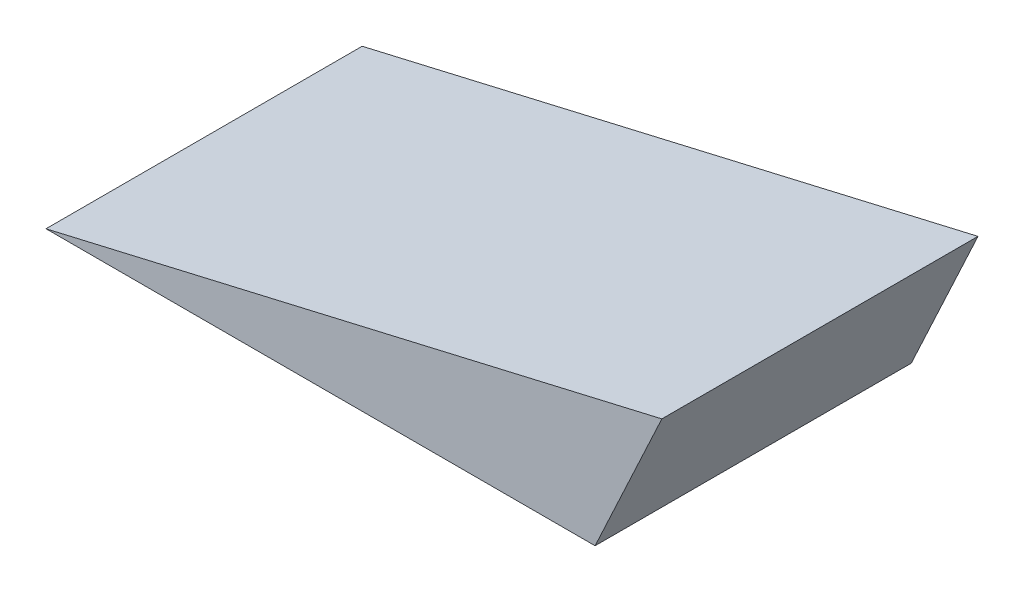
ISO-10303-21;
HEADER;
FILE_DESCRIPTION(('STEP AP214'),'2;1');
FILE_NAME('part.step','',(''),(''),'','','');
FILE_SCHEMA(('AUTOMOTIVE_DESIGN { 1 0 10303 214 1 1 1 1 }'));
ENDSEC;
DATA;
#1=APPLICATION_CONTEXT('core data for automotive mechanical design processes');
#2=APPLICATION_PROTOCOL_DEFINITION('international standard','automotive_design',2000,#1);
#3=PRODUCT_CONTEXT('',#1,'mechanical');
#4=PRODUCT('Part','Part','',(#3));
#5=PRODUCT_RELATED_PRODUCT_CATEGORY('part','',(#4));
#6=PRODUCT_DEFINITION_FORMATION('','',#4);
#7=PRODUCT_DEFINITION_CONTEXT('part definition',#1,'design');
#8=PRODUCT_DEFINITION('design','',#6,#7);
#9=PRODUCT_DEFINITION_SHAPE('','',#8);
#10=(LENGTH_UNIT() NAMED_UNIT(*) SI_UNIT(.MILLI.,.METRE.));
#11=(NAMED_UNIT(*) PLANE_ANGLE_UNIT() SI_UNIT($,.RADIAN.));
#12=(NAMED_UNIT(*) SI_UNIT($,.STERADIAN.) SOLID_ANGLE_UNIT());
#13=UNCERTAINTY_MEASURE_WITH_UNIT(LENGTH_MEASURE(1.E-05),#10,'distance_accuracy_value','');
#14=(GEOMETRIC_REPRESENTATION_CONTEXT(3) GLOBAL_UNCERTAINTY_ASSIGNED_CONTEXT((#13)) GLOBAL_UNIT_ASSIGNED_CONTEXT((#10,
#11,#12)) REPRESENTATION_CONTEXT('',''));
#15=CARTESIAN_POINT('',(0.,0.,0.));
#16=DIRECTION('',(0.,0.,1.));
#17=DIRECTION('',(1.,0.,0.));
#18=AXIS2_PLACEMENT_3D('',#15,#16,#17);
#19=CARTESIAN_POINT('',(4.22362936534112,9.06426803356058,20.));
#20=DIRECTION('',(-0.906426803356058,0.422362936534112,0.));
#21=DIRECTION('',(-0.422362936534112,-0.906426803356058,0.));
#22=AXIS2_PLACEMENT_3D('',#19,#20,#21);
#23=PLANE('',#22);
#24=DIRECTION('',(0.422362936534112,0.906426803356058,0.));
#25=VECTOR('',#24,1.);
#26=CARTESIAN_POINT('',(4.22362936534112,9.06426803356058,0.));
#27=LINE('',#26,#25);
#28=CARTESIAN_POINT('',(0.,0.,0.));
#29=VERTEX_POINT('',#28);
#30=CARTESIAN_POINT('',(4.22362936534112,9.06426803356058,0.));
#31=VERTEX_POINT('',#30);
#32=EDGE_CURVE('E90',#29,#31,#27,.T.);
#33=ORIENTED_EDGE('',*,*,#32,.T.);
#34=DIRECTION('',(0.,0.,-1.));
#35=VECTOR('',#34,1.);
#36=CARTESIAN_POINT('',(4.22362936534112,9.06426803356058,20.));
#37=LINE('',#36,#35);
#38=CARTESIAN_POINT('',(4.22362936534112,9.06426803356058,20.));
#39=VERTEX_POINT('',#38);
#40=EDGE_CURVE('E11',#39,#31,#37,.T.);
#41=ORIENTED_EDGE('',*,*,#40,.F.);
#42=DIRECTION('',(0.422362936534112,0.906426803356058,0.));
#43=VECTOR('',#42,1.);
#44=CARTESIAN_POINT('',(4.22362936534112,9.06426803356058,20.));
#45=LINE('',#44,#43);
#46=CARTESIAN_POINT('',(0.,0.,20.));
#47=VERTEX_POINT('',#46);
#48=EDGE_CURVE('E83',#47,#39,#45,.T.);
#49=ORIENTED_EDGE('',*,*,#48,.F.);
#50=DIRECTION('',(0.,0.,-1.));
#51=VECTOR('',#50,1.);
#52=CARTESIAN_POINT('',(0.,0.,20.));
#53=LINE('',#52,#51);
#54=EDGE_CURVE('E91',#47,#29,#53,.T.);
#55=ORIENTED_EDGE('',*,*,#54,.T.);
#56=EDGE_LOOP('',(#33,#41,#49,#55));
#57=FACE_BOUND('',#56,.T.);
#58=ADVANCED_FACE('F43',(#57),#23,.F.);
#59=CARTESIAN_POINT('',(-34.7358244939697,0.,20.));
#60=DIRECTION('',(0.226606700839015,-0.973986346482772,0.));
#61=DIRECTION('',(0.973986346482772,0.226606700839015,0.));
#62=AXIS2_PLACEMENT_3D('',#59,#60,#61);
#63=PLANE('',#62);
#64=DIRECTION('',(-0.973986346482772,-0.226606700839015,0.));
#65=VECTOR('',#64,1.);
#66=CARTESIAN_POINT('',(-34.7358244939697,0.,0.));
#67=LINE('',#66,#65);
#68=CARTESIAN_POINT('',(-34.7358244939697,0.,0.));
#69=VERTEX_POINT('',#68);
#70=EDGE_CURVE('E71',#31,#69,#67,.T.);
#71=ORIENTED_EDGE('',*,*,#70,.T.);
#72=DIRECTION('',(0.,0.,-1.));
#73=VECTOR('',#72,1.);
#74=CARTESIAN_POINT('',(-34.7358244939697,0.,20.));
#75=LINE('',#74,#73);
#76=CARTESIAN_POINT('',(-34.7358244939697,0.,20.));
#77=VERTEX_POINT('',#76);
#78=EDGE_CURVE('E51',#77,#69,#75,.T.);
#79=ORIENTED_EDGE('',*,*,#78,.F.);
#80=DIRECTION('',(-0.973986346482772,-0.226606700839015,0.));
#81=VECTOR('',#80,1.);
#82=CARTESIAN_POINT('',(-34.7358244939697,0.,20.));
#83=LINE('',#82,#81);
#84=EDGE_CURVE('E79',#39,#77,#83,.T.);
#85=ORIENTED_EDGE('',*,*,#84,.F.);
#86=ORIENTED_EDGE('',*,*,#40,.T.);
#87=EDGE_LOOP('',(#71,#79,#85,#86));
#88=FACE_BOUND('',#87,.T.);
#89=ADVANCED_FACE('F80',(#88),#63,.F.);
#90=CARTESIAN_POINT('',(0.,0.,20.));
#91=DIRECTION('',(0.,1.,0.));
#92=DIRECTION('',(-1.,0.,0.));
#93=AXIS2_PLACEMENT_3D('',#90,#91,#92);
#94=PLANE('',#93);
#95=DIRECTION('',(1.,0.,0.));
#96=VECTOR('',#95,1.);
#97=CARTESIAN_POINT('',(0.,0.,0.));
#98=LINE('',#97,#96);
#99=EDGE_CURVE('E76',#69,#29,#98,.T.);
#100=ORIENTED_EDGE('',*,*,#99,.T.);
#101=ORIENTED_EDGE('',*,*,#54,.F.);
#102=DIRECTION('',(1.,0.,0.));
#103=VECTOR('',#102,1.);
#104=CARTESIAN_POINT('',(0.,0.,20.));
#105=LINE('',#104,#103);
#106=EDGE_CURVE('E59',#77,#47,#105,.T.);
#107=ORIENTED_EDGE('',*,*,#106,.F.);
#108=ORIENTED_EDGE('',*,*,#78,.T.);
#109=EDGE_LOOP('',(#100,#101,#107,#108));
#110=FACE_BOUND('',#109,.T.);
#111=ADVANCED_FACE('F98',(#110),#94,.F.);
#112=CARTESIAN_POINT('',(0.,0.,20.));
#113=DIRECTION('',(0.,0.,-1.));
#114=DIRECTION('',(-1.,0.,0.));
#115=AXIS2_PLACEMENT_3D('',#112,#113,#114);
#116=PLANE('',#115);
#117=ORIENTED_EDGE('',*,*,#48,.T.);
#118=ORIENTED_EDGE('',*,*,#84,.T.);
#119=ORIENTED_EDGE('',*,*,#106,.T.);
#120=EDGE_LOOP('',(#117,#118,#119));
#121=FACE_BOUND('',#120,.T.);
#122=ADVANCED_FACE('F86',(#121),#116,.F.);
#123=CARTESIAN_POINT('',(0.,0.,0.));
#124=DIRECTION('',(0.,0.,-1.));
#125=DIRECTION('',(-1.,0.,0.));
#126=AXIS2_PLACEMENT_3D('',#123,#124,#125);
#127=PLANE('',#126);
#128=ORIENTED_EDGE('',*,*,#32,.F.);
#129=ORIENTED_EDGE('',*,*,#99,.F.);
#130=ORIENTED_EDGE('',*,*,#70,.F.);
#131=EDGE_LOOP('',(#128,#129,#130));
#132=FACE_BOUND('',#131,.T.);
#133=ADVANCED_FACE('F99',(#132),#127,.T.);
#134=CLOSED_SHELL('',(#58,#89,#111,#122,#133));
#135=MANIFOLD_SOLID_BREP('B2',#134);
#136=ADVANCED_BREP_SHAPE_REPRESENTATION('',(#18,#135),#14);
#137=SHAPE_DEFINITION_REPRESENTATION(#9,#136);
ENDSEC;
END-ISO-10303-21;
